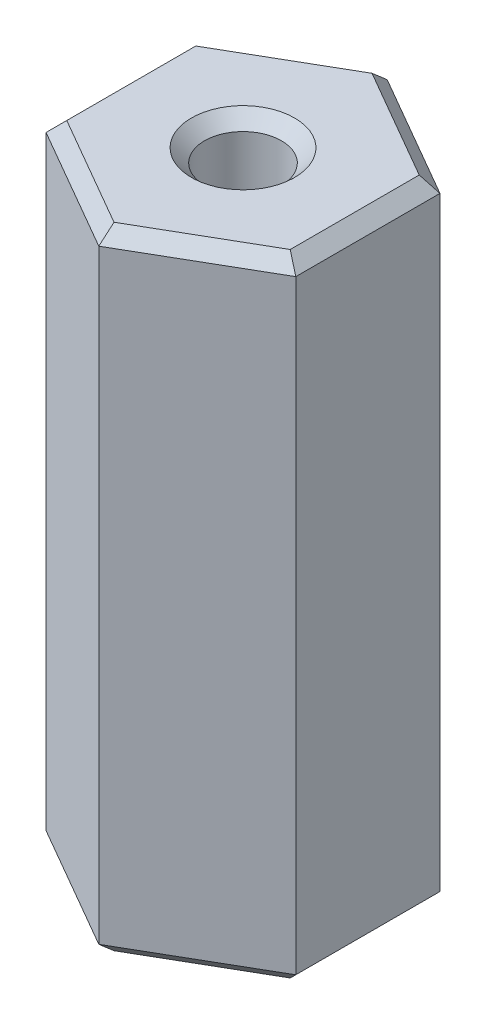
ISO-10303-21;
HEADER;
FILE_DESCRIPTION(('STEP AP214'),'2;1');
FILE_NAME('part.step','',(''),(''),'','','');
FILE_SCHEMA(('AUTOMOTIVE_DESIGN { 1 0 10303 214 1 1 1 1 }'));
ENDSEC;
DATA;
#1=APPLICATION_CONTEXT('core data for automotive mechanical design processes');
#2=APPLICATION_PROTOCOL_DEFINITION('international standard','automotive_design',2000,#1);
#3=PRODUCT_CONTEXT('',#1,'mechanical');
#4=PRODUCT('Part','Part','',(#3));
#5=PRODUCT_RELATED_PRODUCT_CATEGORY('part','',(#4));
#6=PRODUCT_DEFINITION_FORMATION('','',#4);
#7=PRODUCT_DEFINITION_CONTEXT('part definition',#1,'design');
#8=PRODUCT_DEFINITION('design','',#6,#7);
#9=PRODUCT_DEFINITION_SHAPE('','',#8);
#10=(LENGTH_UNIT() NAMED_UNIT(*) SI_UNIT(.MILLI.,.METRE.));
#11=(NAMED_UNIT(*) PLANE_ANGLE_UNIT() SI_UNIT($,.RADIAN.));
#12=(NAMED_UNIT(*) SI_UNIT($,.STERADIAN.) SOLID_ANGLE_UNIT());
#13=UNCERTAINTY_MEASURE_WITH_UNIT(LENGTH_MEASURE(1.E-05),#10,'distance_accuracy_value','');
#14=(GEOMETRIC_REPRESENTATION_CONTEXT(3) GLOBAL_UNCERTAINTY_ASSIGNED_CONTEXT((#13)) GLOBAL_UNIT_ASSIGNED_CONTEXT((#10,
#11,#12)) REPRESENTATION_CONTEXT('',''));
#15=CARTESIAN_POINT('',(0.,0.,0.));
#16=DIRECTION('',(0.,0.,1.));
#17=DIRECTION('',(1.,0.,0.));
#18=AXIS2_PLACEMENT_3D('',#15,#16,#17);
#19=CARTESIAN_POINT('',(-12.925,0.,0.));
#20=DIRECTION('',(0.,1.,0.));
#21=DIRECTION('',(0.,0.,1.));
#22=AXIS2_PLACEMENT_3D('',#19,#20,#21);
#23=PLANE('',#22);
#24=DIRECTION('',(0.,0.,-1.));
#25=VECTOR('',#24,1.);
#26=CARTESIAN_POINT('',(-8.49999999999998,0.,-5.48482755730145));
#27=LINE('',#26,#25);
#28=CARTESIAN_POINT('',(-8.49999999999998,0.,4.90747728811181));
#29=VERTEX_POINT('',#28);
#30=CARTESIAN_POINT('',(-8.49999999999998,0.,-4.90747728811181));
#31=VERTEX_POINT('',#30);
#32=EDGE_CURVE('E162',#29,#31,#27,.T.);
#33=ORIENTED_EDGE('',*,*,#32,.T.);
#34=DIRECTION('',(0.866025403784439,0.,-0.5));
#35=VECTOR('',#34,1.);
#36=CARTESIAN_POINT('',(0.500000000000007,0.,-10.1036297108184));
#37=LINE('',#36,#35);
#38=CARTESIAN_POINT('',(0.,0.,-9.81495457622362));
#39=VERTEX_POINT('',#38);
#40=EDGE_CURVE('E164',#31,#39,#37,.T.);
#41=ORIENTED_EDGE('',*,*,#40,.T.);
#42=DIRECTION('',(0.866025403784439,0.,0.5));
#43=VECTOR('',#42,1.);
#44=CARTESIAN_POINT('',(8.99999999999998,0.,-4.618802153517));
#45=LINE('',#44,#43);
#46=CARTESIAN_POINT('',(8.49999999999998,0.,-4.90747728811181));
#47=VERTEX_POINT('',#46);
#48=EDGE_CURVE('E154',#39,#47,#45,.T.);
#49=ORIENTED_EDGE('',*,*,#48,.T.);
#50=DIRECTION('',(0.,0.,1.));
#51=VECTOR('',#50,1.);
#52=CARTESIAN_POINT('',(8.49999999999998,0.,5.48482755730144));
#53=LINE('',#52,#51);
#54=CARTESIAN_POINT('',(8.49999999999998,0.,4.90747728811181));
#55=VERTEX_POINT('',#54);
#56=EDGE_CURVE('E156',#47,#55,#53,.T.);
#57=ORIENTED_EDGE('',*,*,#56,.T.);
#58=DIRECTION('',(-0.866025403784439,0.,0.5));
#59=VECTOR('',#58,1.);
#60=CARTESIAN_POINT('',(-0.50000000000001,0.,10.1036297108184));
#61=LINE('',#60,#59);
#62=CARTESIAN_POINT('',(0.,0.,9.81495457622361));
#63=VERTEX_POINT('',#62);
#64=EDGE_CURVE('E158',#55,#63,#61,.T.);
#65=ORIENTED_EDGE('',*,*,#64,.T.);
#66=DIRECTION('',(-0.866025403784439,0.,-0.5));
#67=VECTOR('',#66,1.);
#68=CARTESIAN_POINT('',(-8.99999999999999,0.,4.61880215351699));
#69=LINE('',#68,#67);
#70=EDGE_CURVE('E160',#63,#29,#69,.T.);
#71=ORIENTED_EDGE('',*,*,#70,.T.);
#72=EDGE_LOOP('',(#33,#41,#49,#57,#65,#71));
#73=FACE_BOUND('',#72,.T.);
#74=CARTESIAN_POINT('',(0.,0.,0.));
#75=DIRECTION('',(0.,1.,0.));
#76=DIRECTION('',(0.,0.,1.));
#77=AXIS2_PLACEMENT_3D('',#74,#75,#76);
#78=CIRCLE('',#77,3.925);
#79=CARTESIAN_POINT('',(0.,0.,3.925));
#80=VERTEX_POINT('',#79);
#81=EDGE_CURVE('E151',#80,#80,#78,.T.);
#82=ORIENTED_EDGE('',*,*,#81,.T.);
#83=EDGE_LOOP('',(#82));
#84=FACE_BOUND('',#83,.T.);
#85=ADVANCED_FACE('F34',(#73,#84),#23,.F.);
#86=CARTESIAN_POINT('',(0.,0.,0.));
#87=DIRECTION('',(0.,-1.,0.));
#88=DIRECTION('',(0.,0.,-1.));
#89=AXIS2_PLACEMENT_3D('',#86,#87,#88);
#90=CYLINDRICAL_SURFACE('',#89,2.925);
#91=CARTESIAN_POINT('',(0.,1.,0.));
#92=DIRECTION('',(0.,1.,0.));
#93=DIRECTION('',(0.,0.,1.));
#94=AXIS2_PLACEMENT_3D('',#91,#92,#93);
#95=CIRCLE('',#94,2.925);
#96=CARTESIAN_POINT('',(0.,1.,2.925));
#97=VERTEX_POINT('',#96);
#98=EDGE_CURVE('E188',#97,#97,#95,.F.);
#99=ORIENTED_EDGE('',*,*,#98,.T.);
#100=EDGE_LOOP('',(#99));
#101=FACE_BOUND('',#100,.T.);
#102=CARTESIAN_POINT('',(0.,20.,0.));
#103=DIRECTION('',(0.,-1.,0.));
#104=DIRECTION('',(0.,0.,-1.));
#105=AXIS2_PLACEMENT_3D('',#102,#103,#104);
#106=CIRCLE('',#105,2.925);
#107=CARTESIAN_POINT('',(0.,20.,-2.925));
#108=VERTEX_POINT('',#107);
#109=EDGE_CURVE('E137',#108,#108,#106,.T.);
#110=ORIENTED_EDGE('',*,*,#109,.F.);
#111=EDGE_LOOP('',(#110));
#112=FACE_BOUND('',#111,.T.);
#113=ADVANCED_FACE('F133',(#101,#112),#90,.F.);
#114=CARTESIAN_POINT('',(0.,20.,0.));
#115=DIRECTION('',(0.,-1.,0.));
#116=DIRECTION('',(0.,0.,-1.));
#117=AXIS2_PLACEMENT_3D('',#114,#115,#116);
#118=CONICAL_SURFACE('',#117,2.925,0.785398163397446);
#119=CARTESIAN_POINT('',(0.,22.925,0.));
#120=VERTEX_POINT('',#119);
#121=VERTEX_LOOP('',#120);
#122=FACE_BOUND('',#121,.T.);
#123=ORIENTED_EDGE('',*,*,#109,.T.);
#124=EDGE_LOOP('',(#123));
#125=FACE_BOUND('',#124,.T.);
#126=ADVANCED_FACE('F129',(#122,#125),#118,.F.);
#127=CARTESIAN_POINT('',(9.49999999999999,0.,-5.48482755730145));
#128=DIRECTION('',(0.5,0.,-0.866025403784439));
#129=DIRECTION('',(-0.866025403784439,0.,-0.5));
#130=AXIS2_PLACEMENT_3D('',#127,#128,#129);
#131=PLANE('',#130);
#132=DIRECTION('',(0.,1.,0.));
#133=VECTOR('',#132,1.);
#134=CARTESIAN_POINT('',(9.49999999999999,0.,-5.48482755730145));
#135=LINE('',#134,#133);
#136=CARTESIAN_POINT('',(9.49999999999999,1.00000000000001,-5.48482755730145));
#137=VERTEX_POINT('',#136);
#138=CARTESIAN_POINT('',(9.49999999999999,47.,-5.48482755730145));
#139=VERTEX_POINT('',#138);
#140=EDGE_CURVE('E145',#137,#139,#135,.T.);
#141=ORIENTED_EDGE('',*,*,#140,.F.);
#142=DIRECTION('',(-0.866025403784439,0.,-0.5));
#143=VECTOR('',#142,1.);
#144=CARTESIAN_POINT('',(0.,1.00000000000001,-10.9696551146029));
#145=LINE('',#144,#143);
#146=CARTESIAN_POINT('',(0.,1.00000000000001,-10.9696551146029));
#147=VERTEX_POINT('',#146);
#148=EDGE_CURVE('E186',#137,#147,#145,.T.);
#149=ORIENTED_EDGE('',*,*,#148,.T.);
#150=DIRECTION('',(0.,1.,0.));
#151=VECTOR('',#150,1.);
#152=CARTESIAN_POINT('',(0.,0.,-10.9696551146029));
#153=LINE('',#152,#151);
#154=CARTESIAN_POINT('',(0.,47.,-10.9696551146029));
#155=VERTEX_POINT('',#154);
#156=EDGE_CURVE('E219',#147,#155,#153,.T.);
#157=ORIENTED_EDGE('',*,*,#156,.T.);
#158=DIRECTION('',(0.866025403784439,0.,0.5));
#159=VECTOR('',#158,1.);
#160=CARTESIAN_POINT('',(9.49999999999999,47.,-5.48482755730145));
#161=LINE('',#160,#159);
#162=EDGE_CURVE('E184',#155,#139,#161,.T.);
#163=ORIENTED_EDGE('',*,*,#162,.T.);
#164=EDGE_LOOP('',(#141,#149,#157,#163));
#165=FACE_BOUND('',#164,.T.);
#166=ADVANCED_FACE('F132',(#165),#131,.T.);
#167=CARTESIAN_POINT('',(9.49999999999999,0.,5.48482755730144));
#168=DIRECTION('',(1.,0.,0.));
#169=DIRECTION('',(0.,0.,-1.));
#170=AXIS2_PLACEMENT_3D('',#167,#168,#169);
#171=PLANE('',#170);
#172=DIRECTION('',(0.,1.,0.));
#173=VECTOR('',#172,1.);
#174=CARTESIAN_POINT('',(9.49999999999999,0.,5.48482755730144));
#175=LINE('',#174,#173);
#176=CARTESIAN_POINT('',(9.49999999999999,1.00000000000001,5.48482755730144));
#177=VERTEX_POINT('',#176);
#178=CARTESIAN_POINT('',(9.49999999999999,47.,5.48482755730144));
#179=VERTEX_POINT('',#178);
#180=EDGE_CURVE('E264',#177,#179,#175,.T.);
#181=ORIENTED_EDGE('',*,*,#180,.F.);
#182=DIRECTION('',(0.,0.,-1.));
#183=VECTOR('',#182,1.);
#184=CARTESIAN_POINT('',(9.49999999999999,1.00000000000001,-5.48482755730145));
#185=LINE('',#184,#183);
#186=EDGE_CURVE('E182',#177,#137,#185,.T.);
#187=ORIENTED_EDGE('',*,*,#186,.T.);
#188=ORIENTED_EDGE('',*,*,#140,.T.);
#189=DIRECTION('',(0.,0.,1.));
#190=VECTOR('',#189,1.);
#191=CARTESIAN_POINT('',(9.49999999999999,47.,5.48482755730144));
#192=LINE('',#191,#190);
#193=EDGE_CURVE('E179',#139,#179,#192,.T.);
#194=ORIENTED_EDGE('',*,*,#193,.T.);
#195=EDGE_LOOP('',(#181,#187,#188,#194));
#196=FACE_BOUND('',#195,.T.);
#197=ADVANCED_FACE('F261',(#196),#171,.T.);
#198=CARTESIAN_POINT('',(0.,0.,10.9696551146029));
#199=DIRECTION('',(0.5,0.,0.866025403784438));
#200=DIRECTION('',(0.866025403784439,0.,-0.5));
#201=AXIS2_PLACEMENT_3D('',#198,#199,#200);
#202=PLANE('',#201);
#203=DIRECTION('',(0.,1.,0.));
#204=VECTOR('',#203,1.);
#205=CARTESIAN_POINT('',(0.,0.,10.9696551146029));
#206=LINE('',#205,#204);
#207=CARTESIAN_POINT('',(0.,1.00000000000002,10.9696551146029));
#208=VERTEX_POINT('',#207);
#209=CARTESIAN_POINT('',(0.,47.,10.9696551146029));
#210=VERTEX_POINT('',#209);
#211=EDGE_CURVE('E266',#208,#210,#206,.T.);
#212=ORIENTED_EDGE('',*,*,#211,.F.);
#213=DIRECTION('',(0.866025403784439,0.,-0.5));
#214=VECTOR('',#213,1.);
#215=CARTESIAN_POINT('',(9.49999999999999,1.00000000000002,5.48482755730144));
#216=LINE('',#215,#214);
#217=EDGE_CURVE('E177',#208,#177,#216,.T.);
#218=ORIENTED_EDGE('',*,*,#217,.T.);
#219=ORIENTED_EDGE('',*,*,#180,.T.);
#220=DIRECTION('',(-0.866025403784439,0.,0.5));
#221=VECTOR('',#220,1.);
#222=CARTESIAN_POINT('',(0.,47.,10.9696551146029));
#223=LINE('',#222,#221);
#224=EDGE_CURVE('E175',#179,#210,#223,.T.);
#225=ORIENTED_EDGE('',*,*,#224,.T.);
#226=EDGE_LOOP('',(#212,#218,#219,#225));
#227=FACE_BOUND('',#226,.T.);
#228=ADVANCED_FACE('F316',(#227),#202,.T.);
#229=CARTESIAN_POINT('',(-9.5,0.,5.48482755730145));
#230=DIRECTION('',(-0.5,0.,0.866025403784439));
#231=DIRECTION('',(0.866025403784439,0.,0.5));
#232=AXIS2_PLACEMENT_3D('',#229,#230,#231);
#233=PLANE('',#232);
#234=DIRECTION('',(0.,1.,0.));
#235=VECTOR('',#234,1.);
#236=CARTESIAN_POINT('',(-9.5,0.,5.48482755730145));
#237=LINE('',#236,#235);
#238=CARTESIAN_POINT('',(-9.5,1.00000000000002,5.48482755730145));
#239=VERTEX_POINT('',#238);
#240=CARTESIAN_POINT('',(-9.5,47.,5.48482755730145));
#241=VERTEX_POINT('',#240);
#242=EDGE_CURVE('E271',#239,#241,#237,.T.);
#243=ORIENTED_EDGE('',*,*,#242,.F.);
#244=DIRECTION('',(0.866025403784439,0.,0.5));
#245=VECTOR('',#244,1.);
#246=CARTESIAN_POINT('',(0.,1.00000000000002,10.9696551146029));
#247=LINE('',#246,#245);
#248=EDGE_CURVE('E173',#239,#208,#247,.T.);
#249=ORIENTED_EDGE('',*,*,#248,.T.);
#250=ORIENTED_EDGE('',*,*,#211,.T.);
#251=DIRECTION('',(-0.866025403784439,0.,-0.5));
#252=VECTOR('',#251,1.);
#253=CARTESIAN_POINT('',(-9.5,47.,5.48482755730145));
#254=LINE('',#253,#252);
#255=EDGE_CURVE('E171',#210,#241,#254,.T.);
#256=ORIENTED_EDGE('',*,*,#255,.T.);
#257=EDGE_LOOP('',(#243,#249,#250,#256));
#258=FACE_BOUND('',#257,.T.);
#259=ADVANCED_FACE('F286',(#258),#233,.T.);
#260=CARTESIAN_POINT('',(-9.5,0.,-5.48482755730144));
#261=DIRECTION('',(-1.,0.,0.));
#262=DIRECTION('',(0.,0.,1.));
#263=AXIS2_PLACEMENT_3D('',#260,#261,#262);
#264=PLANE('',#263);
#265=DIRECTION('',(0.,1.,0.));
#266=VECTOR('',#265,1.);
#267=CARTESIAN_POINT('',(-9.5,0.,-5.48482755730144));
#268=LINE('',#267,#266);
#269=CARTESIAN_POINT('',(-9.5,1.00000000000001,-5.48482755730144));
#270=VERTEX_POINT('',#269);
#271=CARTESIAN_POINT('',(-9.5,47.,-5.48482755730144));
#272=VERTEX_POINT('',#271);
#273=EDGE_CURVE('E274',#270,#272,#268,.T.);
#274=ORIENTED_EDGE('',*,*,#273,.F.);
#275=DIRECTION('',(0.,0.,1.));
#276=VECTOR('',#275,1.);
#277=CARTESIAN_POINT('',(-9.5,1.00000000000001,5.48482755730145));
#278=LINE('',#277,#276);
#279=EDGE_CURVE('E169',#270,#239,#278,.T.);
#280=ORIENTED_EDGE('',*,*,#279,.T.);
#281=ORIENTED_EDGE('',*,*,#242,.T.);
#282=DIRECTION('',(0.,0.,-1.));
#283=VECTOR('',#282,1.);
#284=CARTESIAN_POINT('',(-9.5,47.,-5.48482755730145));
#285=LINE('',#284,#283);
#286=EDGE_CURVE('E167',#241,#272,#285,.T.);
#287=ORIENTED_EDGE('',*,*,#286,.T.);
#288=EDGE_LOOP('',(#274,#280,#281,#287));
#289=FACE_BOUND('',#288,.T.);
#290=ADVANCED_FACE('F281',(#289),#264,.T.);
#291=CARTESIAN_POINT('',(0.,0.,-10.9696551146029));
#292=DIRECTION('',(-0.5,0.,-0.866025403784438));
#293=DIRECTION('',(-0.866025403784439,0.,0.5));
#294=AXIS2_PLACEMENT_3D('',#291,#292,#293);
#295=PLANE('',#294);
#296=ORIENTED_EDGE('',*,*,#156,.F.);
#297=DIRECTION('',(-0.866025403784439,0.,0.5));
#298=VECTOR('',#297,1.);
#299=CARTESIAN_POINT('',(-9.5,1.00000000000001,-5.48482755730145));
#300=LINE('',#299,#298);
#301=EDGE_CURVE('E142',#147,#270,#300,.T.);
#302=ORIENTED_EDGE('',*,*,#301,.T.);
#303=ORIENTED_EDGE('',*,*,#273,.T.);
#304=DIRECTION('',(0.866025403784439,0.,-0.5));
#305=VECTOR('',#304,1.);
#306=CARTESIAN_POINT('',(0.,47.,-10.9696551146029));
#307=LINE('',#306,#305);
#308=EDGE_CURVE('E139',#272,#155,#307,.T.);
#309=ORIENTED_EDGE('',*,*,#308,.T.);
#310=EDGE_LOOP('',(#296,#302,#303,#309));
#311=FACE_BOUND('',#310,.T.);
#312=ADVANCED_FACE('F278',(#311),#295,.T.);
#313=CARTESIAN_POINT('',(0.,25.075,0.));
#314=DIRECTION('',(0.,1.,0.));
#315=DIRECTION('',(0.,0.,1.));
#316=AXIS2_PLACEMENT_3D('',#313,#314,#315);
#317=CONICAL_SURFACE('',#316,0.,0.78539816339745);
#318=CARTESIAN_POINT('',(0.,28.,0.));
#319=DIRECTION('',(0.,-1.,0.));
#320=DIRECTION('',(0.,0.,-1.));
#321=AXIS2_PLACEMENT_3D('',#318,#319,#320);
#322=CIRCLE('',#321,2.925);
#323=CARTESIAN_POINT('',(0.,28.,-2.925));
#324=VERTEX_POINT('',#323);
#325=EDGE_CURVE('E140',#324,#324,#322,.T.);
#326=ORIENTED_EDGE('',*,*,#325,.F.);
#327=EDGE_LOOP('',(#326));
#328=FACE_BOUND('',#327,.T.);
#329=CARTESIAN_POINT('',(0.,25.075,0.));
#330=VERTEX_POINT('',#329);
#331=VERTEX_LOOP('',#330);
#332=FACE_BOUND('',#331,.T.);
#333=ADVANCED_FACE('F447',(#328,#332),#317,.F.);
#334=CARTESIAN_POINT('',(0.,0.,0.));
#335=DIRECTION('',(0.,-1.,0.));
#336=DIRECTION('',(0.,0.,-1.));
#337=AXIS2_PLACEMENT_3D('',#334,#335,#336);
#338=CYLINDRICAL_SURFACE('',#337,2.925);
#339=CARTESIAN_POINT('',(0.,47.,0.));
#340=DIRECTION('',(0.,-1.,0.));
#341=DIRECTION('',(0.,0.,-1.));
#342=AXIS2_PLACEMENT_3D('',#339,#340,#341);
#343=CIRCLE('',#342,2.925);
#344=CARTESIAN_POINT('',(0.,47.,-2.925));
#345=VERTEX_POINT('',#344);
#346=EDGE_CURVE('E12',#345,#345,#343,.F.);
#347=ORIENTED_EDGE('',*,*,#346,.T.);
#348=EDGE_LOOP('',(#347));
#349=FACE_BOUND('',#348,.T.);
#350=ORIENTED_EDGE('',*,*,#325,.T.);
#351=EDGE_LOOP('',(#350));
#352=FACE_BOUND('',#351,.T.);
#353=ADVANCED_FACE('F496',(#349,#352),#338,.F.);
#354=CARTESIAN_POINT('',(-2.925,48.,0.));
#355=DIRECTION('',(0.,-1.,0.));
#356=DIRECTION('',(0.,0.,-1.));
#357=AXIS2_PLACEMENT_3D('',#354,#355,#356);
#358=PLANE('',#357);
#359=DIRECTION('',(0.866025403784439,0.,-0.5));
#360=VECTOR('',#359,1.);
#361=CARTESIAN_POINT('',(8.99999999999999,48.,4.61880215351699));
#362=LINE('',#361,#360);
#363=CARTESIAN_POINT('',(0.,48.,9.81495457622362));
#364=VERTEX_POINT('',#363);
#365=CARTESIAN_POINT('',(8.49999999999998,48.,4.90747728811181));
#366=VERTEX_POINT('',#365);
#367=EDGE_CURVE('E51',#364,#366,#362,.T.);
#368=ORIENTED_EDGE('',*,*,#367,.T.);
#369=DIRECTION('',(0.,0.,-1.));
#370=VECTOR('',#369,1.);
#371=CARTESIAN_POINT('',(8.49999999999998,48.,-5.48482755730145));
#372=LINE('',#371,#370);
#373=CARTESIAN_POINT('',(8.49999999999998,48.,-4.90747728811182));
#374=VERTEX_POINT('',#373);
#375=EDGE_CURVE('E43',#366,#374,#372,.T.);
#376=ORIENTED_EDGE('',*,*,#375,.T.);
#377=DIRECTION('',(-0.866025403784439,0.,-0.5));
#378=VECTOR('',#377,1.);
#379=CARTESIAN_POINT('',(-0.500000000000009,48.,-10.1036297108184));
#380=LINE('',#379,#378);
#381=CARTESIAN_POINT('',(0.,48.,-9.81495457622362));
#382=VERTEX_POINT('',#381);
#383=EDGE_CURVE('E194',#374,#382,#380,.T.);
#384=ORIENTED_EDGE('',*,*,#383,.T.);
#385=DIRECTION('',(-0.866025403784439,0.,0.5));
#386=VECTOR('',#385,1.);
#387=CARTESIAN_POINT('',(-8.99999999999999,48.,-4.61880215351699));
#388=LINE('',#387,#386);
#389=CARTESIAN_POINT('',(-8.49999999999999,48.,-4.90747728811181));
#390=VERTEX_POINT('',#389);
#391=EDGE_CURVE('E196',#382,#390,#388,.T.);
#392=ORIENTED_EDGE('',*,*,#391,.T.);
#393=DIRECTION('',(0.,0.,1.));
#394=VECTOR('',#393,1.);
#395=CARTESIAN_POINT('',(-8.49999999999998,48.,5.48482755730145));
#396=LINE('',#395,#394);
#397=CARTESIAN_POINT('',(-8.49999999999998,48.,4.90747728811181));
#398=VERTEX_POINT('',#397);
#399=EDGE_CURVE('E198',#390,#398,#396,.T.);
#400=ORIENTED_EDGE('',*,*,#399,.T.);
#401=DIRECTION('',(0.866025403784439,0.,0.5));
#402=VECTOR('',#401,1.);
#403=CARTESIAN_POINT('',(0.500000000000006,48.,10.1036297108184));
#404=LINE('',#403,#402);
#405=EDGE_CURVE('E56',#398,#364,#404,.T.);
#406=ORIENTED_EDGE('',*,*,#405,.T.);
#407=EDGE_LOOP('',(#368,#376,#384,#392,#400,#406));
#408=FACE_BOUND('',#407,.T.);
#409=CARTESIAN_POINT('',(0.,48.,0.));
#410=DIRECTION('',(0.,-1.,0.));
#411=DIRECTION('',(0.,0.,-1.));
#412=AXIS2_PLACEMENT_3D('',#409,#410,#411);
#413=CIRCLE('',#412,3.925);
#414=CARTESIAN_POINT('',(0.,48.,-3.925));
#415=VERTEX_POINT('',#414);
#416=EDGE_CURVE('E191',#415,#415,#413,.T.);
#417=ORIENTED_EDGE('',*,*,#416,.T.);
#418=EDGE_LOOP('',(#417));
#419=FACE_BOUND('',#418,.T.);
#420=ADVANCED_FACE('F245',(#408,#419),#358,.F.);
#421=CARTESIAN_POINT('',(0.,1.00000000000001,10.9696551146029));
#422=DIRECTION('',(0.353553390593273,-0.707106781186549,0.612372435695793));
#423=DIRECTION('',(-0.866025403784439,0.,0.5));
#424=AXIS2_PLACEMENT_3D('',#421,#422,#423);
#425=PLANE('',#424);
#426=DIRECTION('',(0.,-0.654653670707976,-0.755928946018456));
#427=VECTOR('',#426,1.);
#428=CARTESIAN_POINT('',(0.,1.00000000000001,10.9696551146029));
#429=LINE('',#428,#427);
#430=EDGE_CURVE('E213',#63,#208,#429,.F.);
#431=ORIENTED_EDGE('',*,*,#430,.F.);
#432=ORIENTED_EDGE('',*,*,#64,.F.);
#433=DIRECTION('',(-0.654653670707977,-0.654653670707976,-0.377964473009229));
#434=VECTOR('',#433,1.);
#435=CARTESIAN_POINT('',(9.49999999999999,1.00000000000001,5.48482755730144));
#436=LINE('',#435,#434);
#437=EDGE_CURVE('E216',#177,#55,#436,.T.);
#438=ORIENTED_EDGE('',*,*,#437,.F.);
#439=ORIENTED_EDGE('',*,*,#217,.F.);
#440=EDGE_LOOP('',(#431,#432,#438,#439));
#441=FACE_BOUND('',#440,.T.);
#442=ADVANCED_FACE('F314',(#441),#425,.T.);
#443=CARTESIAN_POINT('',(9.49999999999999,1.00000000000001,5.48482755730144));
#444=DIRECTION('',(0.707106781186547,-0.707106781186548,0.));
#445=DIRECTION('',(0.,0.,1.));
#446=AXIS2_PLACEMENT_3D('',#443,#444,#445);
#447=PLANE('',#446);
#448=ORIENTED_EDGE('',*,*,#437,.T.);
#449=ORIENTED_EDGE('',*,*,#56,.F.);
#450=DIRECTION('',(-0.654653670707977,-0.654653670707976,0.377964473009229));
#451=VECTOR('',#450,1.);
#452=CARTESIAN_POINT('',(9.49999999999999,1.00000000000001,-5.48482755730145));
#453=LINE('',#452,#451);
#454=EDGE_CURVE('E210',#137,#47,#453,.T.);
#455=ORIENTED_EDGE('',*,*,#454,.F.);
#456=ORIENTED_EDGE('',*,*,#186,.F.);
#457=EDGE_LOOP('',(#448,#449,#455,#456));
#458=FACE_BOUND('',#457,.T.);
#459=ADVANCED_FACE('F310',(#458),#447,.T.);
#460=CARTESIAN_POINT('',(-9.5,1.00000000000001,5.48482755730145));
#461=DIRECTION('',(-0.353553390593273,-0.707106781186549,0.612372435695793));
#462=DIRECTION('',(-0.866025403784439,0.,-0.5));
#463=AXIS2_PLACEMENT_3D('',#460,#461,#462);
#464=PLANE('',#463);
#465=ORIENTED_EDGE('',*,*,#430,.T.);
#466=ORIENTED_EDGE('',*,*,#248,.F.);
#467=DIRECTION('',(0.654653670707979,-0.654653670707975,-0.377964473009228));
#468=VECTOR('',#467,1.);
#469=CARTESIAN_POINT('',(-9.5,1.00000000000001,5.48482755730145));
#470=LINE('',#469,#468);
#471=EDGE_CURVE('E207',#29,#239,#470,.F.);
#472=ORIENTED_EDGE('',*,*,#471,.F.);
#473=ORIENTED_EDGE('',*,*,#70,.F.);
#474=EDGE_LOOP('',(#465,#466,#472,#473));
#475=FACE_BOUND('',#474,.T.);
#476=ADVANCED_FACE('F290',(#475),#464,.T.);
#477=CARTESIAN_POINT('',(9.49999999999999,1.00000000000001,-5.48482755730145));
#478=DIRECTION('',(0.353553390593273,-0.707106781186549,-0.612372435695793));
#479=DIRECTION('',(0.866025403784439,0.,0.5));
#480=AXIS2_PLACEMENT_3D('',#477,#478,#479);
#481=PLANE('',#480);
#482=ORIENTED_EDGE('',*,*,#454,.T.);
#483=ORIENTED_EDGE('',*,*,#48,.F.);
#484=DIRECTION('',(0.,0.654653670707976,-0.755928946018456));
#485=VECTOR('',#484,1.);
#486=CARTESIAN_POINT('',(0.,-1.71428571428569,-7.83546793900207));
#487=LINE('',#486,#485);
#488=EDGE_CURVE('E205',#147,#39,#487,.F.);
#489=ORIENTED_EDGE('',*,*,#488,.F.);
#490=ORIENTED_EDGE('',*,*,#148,.F.);
#491=EDGE_LOOP('',(#482,#483,#489,#490));
#492=FACE_BOUND('',#491,.T.);
#493=ADVANCED_FACE('F306',(#492),#481,.T.);
#494=CARTESIAN_POINT('',(-9.5,1.00000000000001,-5.48482755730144));
#495=DIRECTION('',(-0.707106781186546,-0.707106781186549,0.));
#496=DIRECTION('',(0.,0.,-1.));
#497=AXIS2_PLACEMENT_3D('',#494,#495,#496);
#498=PLANE('',#497);
#499=ORIENTED_EDGE('',*,*,#471,.T.);
#500=ORIENTED_EDGE('',*,*,#279,.F.);
#501=DIRECTION('',(0.654653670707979,-0.654653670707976,0.377964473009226));
#502=VECTOR('',#501,1.);
#503=CARTESIAN_POINT('',(-9.5,1.00000000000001,-5.48482755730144));
#504=LINE('',#503,#502);
#505=EDGE_CURVE('E203',#31,#270,#504,.F.);
#506=ORIENTED_EDGE('',*,*,#505,.F.);
#507=ORIENTED_EDGE('',*,*,#32,.F.);
#508=EDGE_LOOP('',(#499,#500,#506,#507));
#509=FACE_BOUND('',#508,.T.);
#510=ADVANCED_FACE('F295',(#509),#498,.T.);
#511=CARTESIAN_POINT('',(0.,1.00000000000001,-10.9696551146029));
#512=DIRECTION('',(-0.353553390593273,-0.707106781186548,-0.612372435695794));
#513=DIRECTION('',(0.866025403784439,0.,-0.5));
#514=AXIS2_PLACEMENT_3D('',#511,#512,#513);
#515=PLANE('',#514);
#516=ORIENTED_EDGE('',*,*,#488,.T.);
#517=ORIENTED_EDGE('',*,*,#40,.F.);
#518=ORIENTED_EDGE('',*,*,#505,.T.);
#519=ORIENTED_EDGE('',*,*,#301,.F.);
#520=EDGE_LOOP('',(#516,#517,#518,#519));
#521=FACE_BOUND('',#520,.T.);
#522=ADVANCED_FACE('F301',(#521),#515,.T.);
#523=CARTESIAN_POINT('',(0.,1.,0.));
#524=DIRECTION('',(0.,-1.,0.));
#525=DIRECTION('',(0.,0.,-1.));
#526=AXIS2_PLACEMENT_3D('',#523,#524,#525);
#527=CONICAL_SURFACE('',#526,2.925,0.78539816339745);
#528=ORIENTED_EDGE('',*,*,#81,.F.);
#529=EDGE_LOOP('',(#528));
#530=FACE_BOUND('',#529,.T.);
#531=ORIENTED_EDGE('',*,*,#98,.F.);
#532=EDGE_LOOP('',(#531));
#533=FACE_BOUND('',#532,.T.);
#534=ADVANCED_FACE('F343',(#530,#533),#527,.F.);
#535=CARTESIAN_POINT('',(-9.5,47.,-5.48482755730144));
#536=DIRECTION('',(-0.707106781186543,0.707106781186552,0.));
#537=DIRECTION('',(0.,0.,1.));
#538=AXIS2_PLACEMENT_3D('',#535,#536,#537);
#539=PLANE('',#538);
#540=DIRECTION('',(0.654653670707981,0.654653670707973,-0.377964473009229));
#541=VECTOR('',#540,1.);
#542=CARTESIAN_POINT('',(-6.78571428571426,49.7142857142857,3.91773396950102));
#543=LINE('',#542,#541);
#544=EDGE_CURVE('E229',#398,#241,#543,.F.);
#545=ORIENTED_EDGE('',*,*,#544,.F.);
#546=ORIENTED_EDGE('',*,*,#399,.F.);
#547=DIRECTION('',(0.654653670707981,0.654653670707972,0.377964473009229));
#548=VECTOR('',#547,1.);
#549=CARTESIAN_POINT('',(-6.78571428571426,49.7142857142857,-3.91773396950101));
#550=LINE('',#549,#548);
#551=EDGE_CURVE('E38',#272,#390,#550,.T.);
#552=ORIENTED_EDGE('',*,*,#551,.F.);
#553=ORIENTED_EDGE('',*,*,#286,.F.);
#554=EDGE_LOOP('',(#545,#546,#552,#553));
#555=FACE_BOUND('',#554,.T.);
#556=ADVANCED_FACE('F244',(#555),#539,.T.);
#557=CARTESIAN_POINT('',(0.,47.,-10.9696551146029));
#558=DIRECTION('',(-0.353553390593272,0.707106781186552,-0.612372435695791));
#559=DIRECTION('',(-0.866025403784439,0.,0.5));
#560=AXIS2_PLACEMENT_3D('',#557,#558,#559);
#561=PLANE('',#560);
#562=ORIENTED_EDGE('',*,*,#551,.T.);
#563=ORIENTED_EDGE('',*,*,#391,.F.);
#564=DIRECTION('',(0.,0.654653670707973,0.755928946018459));
#565=VECTOR('',#564,1.);
#566=CARTESIAN_POINT('',(0.,49.7142857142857,-7.83546793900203));
#567=LINE('',#566,#565);
#568=EDGE_CURVE('E227',#155,#382,#567,.T.);
#569=ORIENTED_EDGE('',*,*,#568,.F.);
#570=ORIENTED_EDGE('',*,*,#308,.F.);
#571=EDGE_LOOP('',(#562,#563,#569,#570));
#572=FACE_BOUND('',#571,.T.);
#573=ADVANCED_FACE('F239',(#572),#561,.T.);
#574=CARTESIAN_POINT('',(-9.5,47.,5.48482755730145));
#575=DIRECTION('',(-0.353553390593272,0.707106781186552,0.612372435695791));
#576=DIRECTION('',(0.866025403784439,0.,0.5));
#577=AXIS2_PLACEMENT_3D('',#574,#575,#576);
#578=PLANE('',#577);
#579=ORIENTED_EDGE('',*,*,#544,.T.);
#580=ORIENTED_EDGE('',*,*,#255,.F.);
#581=DIRECTION('',(0.,0.654653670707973,-0.755928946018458));
#582=VECTOR('',#581,1.);
#583=CARTESIAN_POINT('',(0.,49.7142857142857,7.83546793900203));
#584=LINE('',#583,#582);
#585=EDGE_CURVE('E224',#364,#210,#584,.F.);
#586=ORIENTED_EDGE('',*,*,#585,.F.);
#587=ORIENTED_EDGE('',*,*,#405,.F.);
#588=EDGE_LOOP('',(#579,#580,#586,#587));
#589=FACE_BOUND('',#588,.T.);
#590=ADVANCED_FACE('F318',(#589),#578,.T.);
#591=CARTESIAN_POINT('',(9.49999999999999,47.,-5.48482755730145));
#592=DIRECTION('',(0.353553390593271,0.707106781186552,-0.612372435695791));
#593=DIRECTION('',(-0.866025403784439,0.,-0.5));
#594=AXIS2_PLACEMENT_3D('',#591,#592,#593);
#595=PLANE('',#594);
#596=ORIENTED_EDGE('',*,*,#568,.T.);
#597=ORIENTED_EDGE('',*,*,#383,.F.);
#598=DIRECTION('',(0.654653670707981,-0.654653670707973,-0.377964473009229));
#599=VECTOR('',#598,1.);
#600=CARTESIAN_POINT('',(9.49999999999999,47.,-5.48482755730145));
#601=LINE('',#600,#599);
#602=EDGE_CURVE('E222',#139,#374,#601,.F.);
#603=ORIENTED_EDGE('',*,*,#602,.F.);
#604=ORIENTED_EDGE('',*,*,#162,.F.);
#605=EDGE_LOOP('',(#596,#597,#603,#604));
#606=FACE_BOUND('',#605,.T.);
#607=ADVANCED_FACE('F250',(#606),#595,.T.);
#608=CARTESIAN_POINT('',(0.,47.,10.9696551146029));
#609=DIRECTION('',(0.353553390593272,0.707106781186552,0.612372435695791));
#610=DIRECTION('',(0.866025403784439,0.,-0.5));
#611=AXIS2_PLACEMENT_3D('',#608,#609,#610);
#612=PLANE('',#611);
#613=ORIENTED_EDGE('',*,*,#585,.T.);
#614=ORIENTED_EDGE('',*,*,#224,.F.);
#615=DIRECTION('',(-0.654653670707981,0.654653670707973,-0.377964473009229));
#616=VECTOR('',#615,1.);
#617=CARTESIAN_POINT('',(6.78571428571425,49.7142857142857,3.91773396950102));
#618=LINE('',#617,#616);
#619=EDGE_CURVE('E220',#366,#179,#618,.F.);
#620=ORIENTED_EDGE('',*,*,#619,.F.);
#621=ORIENTED_EDGE('',*,*,#367,.F.);
#622=EDGE_LOOP('',(#613,#614,#620,#621));
#623=FACE_BOUND('',#622,.T.);
#624=ADVANCED_FACE('F320',(#623),#612,.T.);
#625=CARTESIAN_POINT('',(9.49999999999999,47.,5.48482755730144));
#626=DIRECTION('',(0.707106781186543,0.707106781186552,0.));
#627=DIRECTION('',(0.,0.,-1.));
#628=AXIS2_PLACEMENT_3D('',#625,#626,#627);
#629=PLANE('',#628);
#630=ORIENTED_EDGE('',*,*,#602,.T.);
#631=ORIENTED_EDGE('',*,*,#375,.F.);
#632=ORIENTED_EDGE('',*,*,#619,.T.);
#633=ORIENTED_EDGE('',*,*,#193,.F.);
#634=EDGE_LOOP('',(#630,#631,#632,#633));
#635=FACE_BOUND('',#634,.T.);
#636=ADVANCED_FACE('F323',(#635),#629,.T.);
#637=CARTESIAN_POINT('',(0.,48.,0.));
#638=DIRECTION('',(0.,1.,0.));
#639=DIRECTION('',(0.,0.,1.));
#640=AXIS2_PLACEMENT_3D('',#637,#638,#639);
#641=CONICAL_SURFACE('',#640,3.925,0.785398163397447);
#642=ORIENTED_EDGE('',*,*,#346,.F.);
#643=EDGE_LOOP('',(#642));
#644=FACE_BOUND('',#643,.T.);
#645=ORIENTED_EDGE('',*,*,#416,.F.);
#646=EDGE_LOOP('',(#645));
#647=FACE_BOUND('',#646,.T.);
#648=ADVANCED_FACE('F36',(#644,#647),#641,.F.);
#649=CLOSED_SHELL('',(#85,#113,#126,#166,#197,#228,#259,#290,#312,#333,#353,#420,#442,#459,#476,
#493,#510,#522,#534,#556,#573,#590,#607,#624,#636,#648));
#650=MANIFOLD_SOLID_BREP('B2',#649);
#651=ADVANCED_BREP_SHAPE_REPRESENTATION('',(#18,#650),#14);
#652=SHAPE_DEFINITION_REPRESENTATION(#9,#651);
ENDSEC;
END-ISO-10303-21;
